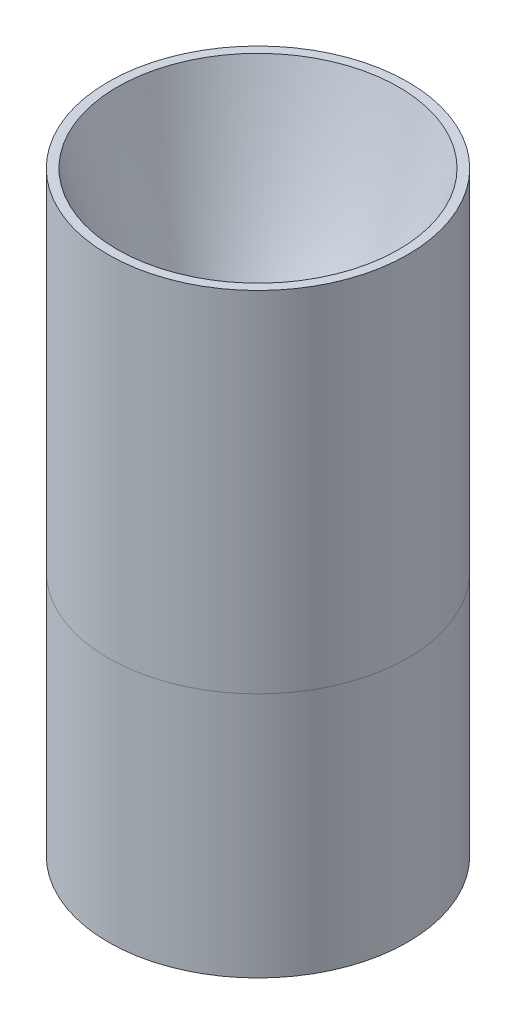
from build123d import *

# Parameters (mm, degrees)
SHORTEN_CHAMBER_75IN_BY = 19.05
SPLIT1_SURFACE_1_BACK   = 372.838
SPLIT1_SURFACE_1_DEPTH  = 745.676
SPLIT1_SURFACE_2_BACK   = 372.838
SPLIT1_SURFACE_2_DEPTH  = 745.676


with BuildPart() as part:
    # Sketch1 → Revolve2 (revolve)
    with BuildSketch(Plane.XY, mode=Mode.PRIVATE) as revolve2_sk:
        with BuildLine():
            Line((71.638455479, 109.927347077), (76.2, 109.927347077))
            Line((76.2, 109.927347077), (76.2, -212.127673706))
            Line((76.2, -212.127673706), (53.792460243, -212.127673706))
            Line((53.792460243, -212.127673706), (53.792460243, -59.727673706))
            add(Edge.make_bspline(
                [(53.792460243, -59.727673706), (53.79245901, -59.657143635), (53.791929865, -59.515566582), (53.78955401, -59.181725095), (53.783229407, -58.904955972), (53.773743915, -58.532727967), (53.761101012, -58.212998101), (53.741350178, -57.781754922), (53.71133783, -57.281120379), (53.667125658, -56.688158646), (53.588220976, -55.848640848), (53.488359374, -55.008326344), (53.367608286, -54.172595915), (53.197743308, -53.172585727), (53.002996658, -52.177603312), (52.777307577, -51.188699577), (52.520946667, -50.207649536), (52.240221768, -49.233238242), (51.935281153, -48.26612973), (51.544470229, -47.149295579), (51.05045274, -45.890568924), (50.509666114, -44.65112933), (49.922993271, -43.432862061), (49.291052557, -42.237253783), (48.615057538, -41.066315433), (47.895407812, -39.921133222), (47.134034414, -38.804236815), (46.430801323, -37.851612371), (45.804470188, -37.055832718), (45.263749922, -36.403541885), (44.826059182, -35.894408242), (44.425708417, -35.447153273), (44.092389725, -35.084791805), (43.784856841, -34.760500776), (43.585004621, -34.551710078), (43.355324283, -34.318676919), (43.25471536, -34.217322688), (43.204843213, -34.167450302)],
                knots=[0.082637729, 0.082637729, 0.082637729, 0.082637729, 0.082637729, 0.092574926, 0.102512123, 0.11244932, 0.122386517, 0.132323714, 0.142260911, 0.162135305, 0.182009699, 0.201884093, 0.24163288, 0.261507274, 0.281381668, 0.321130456, 0.360879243, 0.380753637, 0.400628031, 0.440376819, 0.480125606, 0.519874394, 0.559623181, 0.599371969, 0.639120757, 0.678869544, 0.718618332, 0.75836712, 0.798115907, 0.817990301, 0.837864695, 0.857739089, 0.877613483, 0.88755068, 0.897487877, 0.907425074, 0.91736227, 0.91736227, 0.91736227, 0.91736227, 0.91736227], degree=4))
            Line((43.204843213, -34.167450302), (34.597215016, -25.559822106))
            add(Edge.make_bspline(
                [(24.01, 0), (24.010001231, -0.070528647), (24.010530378, -0.21358419), (24.012906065, -0.543182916), (24.01923046, -0.824160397), (24.028715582, -1.194822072), (24.041357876, -1.513435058), (24.0571581, -1.861939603), (24.07611336, -2.193706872), (24.103750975, -2.6180694), (24.143219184, -3.122033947), (24.214231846, -3.879978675), (24.33405882, -4.886450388), (24.51041819, -6.05671076), (24.761817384, -7.385166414), (25.062727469, -8.703574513), (25.412702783, -10.009637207), (25.811293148, -11.301819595), (26.25787756, -12.578099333), (26.751935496, -13.836887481), (27.292605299, -15.076197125), (27.879411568, -16.29460979), (28.511071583, -17.489938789), (29.187464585, -18.661287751), (29.906377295, -19.80574339), (30.668954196, -20.923860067), (31.370099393, -21.874411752), (31.999668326, -22.673445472), (32.535060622, -23.320422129), (32.983187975, -23.840005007), (33.419382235, -24.329816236), (33.846758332, -24.788484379), (34.156490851, -25.113868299), (34.44779217, -25.409649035), (34.547344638, -25.509949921), (34.597215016, -25.559822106)],
                knots=[0.082637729, 0.082637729, 0.082637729, 0.082637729, 0.082637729, 0.092574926, 0.102512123, 0.11244932, 0.122386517, 0.132323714, 0.142260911, 0.152198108, 0.162135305, 0.182009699, 0.201884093, 0.24163288, 0.281381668, 0.321130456, 0.360879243, 0.400628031, 0.440376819, 0.480125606, 0.519874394, 0.559623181, 0.599371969, 0.639120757, 0.678869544, 0.718618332, 0.75836712, 0.798115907, 0.817990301, 0.837864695, 0.857739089, 0.877613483, 0.897487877, 0.907425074, 0.91736227, 0.91736227, 0.91736227, 0.91736227, 0.91736227], degree=4))
            add(Edge.make_bspline(
                [(24.01, 0), (24.010000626, 0.035892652), (24.010538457, 0.11011369), (24.012955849, 0.267641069), (24.019393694, 0.427064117), (24.031465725, 0.646764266), (24.052367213, 0.901433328), (24.086116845, 1.202537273), (24.137431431, 1.542050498), (24.201475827, 1.880996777), (24.278073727, 2.21635442), (24.367255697, 2.549239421), (24.468673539, 2.878092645), (24.582551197, 3.203347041), (24.708128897, 3.523627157), (24.846218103, 3.839666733), (24.995002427, 4.149282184), (25.156944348, 4.454783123), (25.327420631, 4.751301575), (25.513446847, 5.045703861), (25.702720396, 5.325518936), (25.9153376, 5.610727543), (26.0898085, 5.832913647), (26.277277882, 6.049951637), (26.415487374, 6.208641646), (26.581374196, 6.382121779), (26.655452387, 6.458478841), (26.706211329, 6.50923965)],
                knots=[0.082568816, 0.082568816, 0.082568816, 0.082568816, 0.082568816, 0.102426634, 0.122284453, 0.142142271, 0.162000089, 0.201715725, 0.241431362, 0.281146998, 0.320862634, 0.360578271, 0.400293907, 0.440009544, 0.47972518, 0.519440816, 0.559156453, 0.598872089, 0.638587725, 0.678303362, 0.718018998, 0.757734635, 0.797450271, 0.837165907, 0.857023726, 0.876881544, 0.91659718, 0.91659718, 0.91659718, 0.91659718, 0.91659718], degree=4))
            add(Edge.make_bspline(
                [(26.706211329, 6.50923965), (49.172333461, 34.635954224), (71.638455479, 109.927347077)],
                knots=[0, 0, 0, 1, 1, 1], degree=2))
        make_face()
    revolve(revolve2_sk.sketch.rotate(Axis((0, 0, 0), (0, -1, 0)), 90), axis=Axis((0, 0, 0), (0, -1, 0)))

    # shorten_chamber_.75in: a face moved inward by 19.05
    extrude(part.faces().sort_by_distance((60.96, -212.127673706, 0))[0], amount=SHORTEN_CHAMBER_75IN_BY, dir=(0, 1, 0), mode=Mode.SUBTRACT)


with BuildPart() as body_2:
    # Split1: the piece behind the surface
    add(part.part)
    # Split1 surface: a surface, the sketch's curves swept straight by 745.676 mm
    with BuildLine(Plane.XY.offset(-SPLIT1_SURFACE_1_BACK), mode=Mode.PRIVATE) as split1_surface_1_path:
        Line((-76.2, -67.872652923), (76.2, -67.872652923))
    split1_surface_1 = Shell.extrude(split1_surface_1_path.wire(), (0 * SPLIT1_SURFACE_1_DEPTH, 0 * SPLIT1_SURFACE_1_DEPTH, 1 * SPLIT1_SURFACE_1_DEPTH))
    split(bisect_by=split1_surface_1, keep=Keep.BOTTOM)


with BuildPart() as part_1:
    add(part.part)

    # Split1: split by a surface, the side it looks to stays
    # Split1 surface: a surface, the sketch's curves swept straight by 745.676 mm
    with BuildLine(Plane.XY.offset(-SPLIT1_SURFACE_2_BACK), mode=Mode.PRIVATE) as split1_surface_2_path:
        Line((-76.2, -67.872652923), (76.2, -67.872652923))
    split1_surface_2 = Shell.extrude(split1_surface_2_path.wire(), (0 * SPLIT1_SURFACE_2_DEPTH, 0 * SPLIT1_SURFACE_2_DEPTH, 1 * SPLIT1_SURFACE_2_DEPTH))
    split(bisect_by=split1_surface_2, keep=Keep.TOP)


solid = Compound([body_2.part, part_1.part])
